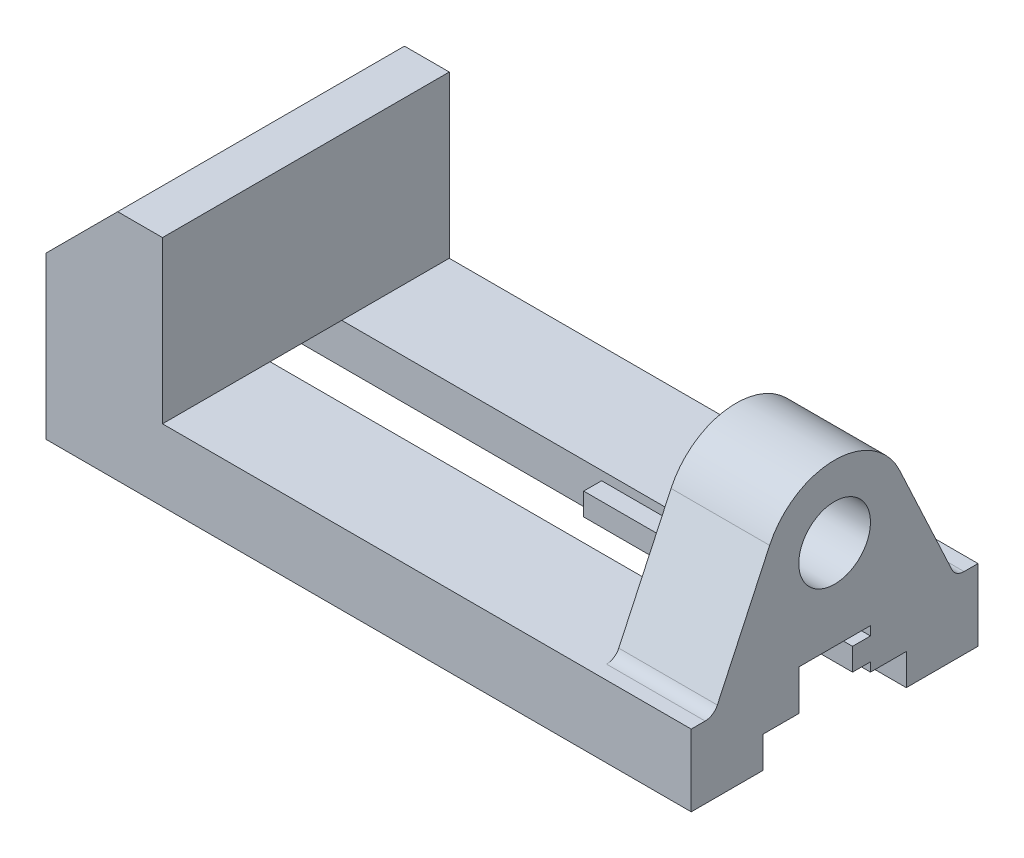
ISO-10303-21;
HEADER;
FILE_DESCRIPTION(('STEP AP214'),'2;1');
FILE_NAME('part.step','',(''),(''),'','','');
FILE_SCHEMA(('AUTOMOTIVE_DESIGN { 1 0 10303 214 1 1 1 1 }'));
ENDSEC;
DATA;
#1=APPLICATION_CONTEXT('core data for automotive mechanical design processes');
#2=APPLICATION_PROTOCOL_DEFINITION('international standard','automotive_design',2000,#1);
#3=PRODUCT_CONTEXT('',#1,'mechanical');
#4=PRODUCT('Part','Part','',(#3));
#5=PRODUCT_RELATED_PRODUCT_CATEGORY('part','',(#4));
#6=PRODUCT_DEFINITION_FORMATION('','',#4);
#7=PRODUCT_DEFINITION_CONTEXT('part definition',#1,'design');
#8=PRODUCT_DEFINITION('design','',#6,#7);
#9=PRODUCT_DEFINITION_SHAPE('','',#8);
#10=(LENGTH_UNIT() NAMED_UNIT(*) SI_UNIT(.MILLI.,.METRE.));
#11=(NAMED_UNIT(*) PLANE_ANGLE_UNIT() SI_UNIT($,.RADIAN.));
#12=(NAMED_UNIT(*) SI_UNIT($,.STERADIAN.) SOLID_ANGLE_UNIT());
#13=UNCERTAINTY_MEASURE_WITH_UNIT(LENGTH_MEASURE(1.E-05),#10,'distance_accuracy_value','');
#14=(GEOMETRIC_REPRESENTATION_CONTEXT(3) GLOBAL_UNCERTAINTY_ASSIGNED_CONTEXT((#13)) GLOBAL_UNIT_ASSIGNED_CONTEXT((#10,
#11,#12)) REPRESENTATION_CONTEXT('',''));
#15=CARTESIAN_POINT('',(0.,0.,0.));
#16=DIRECTION('',(0.,0.,1.));
#17=DIRECTION('',(1.,0.,0.));
#18=AXIS2_PLACEMENT_3D('',#15,#16,#17);
#19=CARTESIAN_POINT('',(26.,16.,32.));
#20=DIRECTION('',(0.,-1.,0.));
#21=DIRECTION('',(0.,0.,-1.));
#22=AXIS2_PLACEMENT_3D('',#19,#20,#21);
#23=PLANE('',#22);
#24=DIRECTION('',(0.,0.,-1.));
#25=VECTOR('',#24,1.);
#26=CARTESIAN_POINT('',(144.,16.,32.));
#27=LINE('',#26,#25);
#28=CARTESIAN_POINT('',(144.,16.,32.));
#29=VERTEX_POINT('',#28);
#30=CARTESIAN_POINT('',(144.,16.,28.8914106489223));
#31=VERTEX_POINT('',#30);
#32=EDGE_CURVE('E433',#29,#31,#27,.T.);
#33=ORIENTED_EDGE('',*,*,#32,.T.);
#34=DIRECTION('',(1.,0.,0.));
#35=VECTOR('',#34,1.);
#36=CARTESIAN_POINT('',(26.,16.,28.8914106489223));
#37=LINE('',#36,#35);
#38=CARTESIAN_POINT('',(122.,16.,28.8914106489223));
#39=VERTEX_POINT('',#38);
#40=EDGE_CURVE('E444',#31,#39,#37,.F.);
#41=ORIENTED_EDGE('',*,*,#40,.T.);
#42=DIRECTION('',(0.,0.,-1.));
#43=VECTOR('',#42,1.);
#44=CARTESIAN_POINT('',(122.,16.,26.9801998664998));
#45=LINE('',#44,#43);
#46=CARTESIAN_POINT('',(122.,16.,8.));
#47=VERTEX_POINT('',#46);
#48=EDGE_CURVE('E361',#39,#47,#45,.T.);
#49=ORIENTED_EDGE('',*,*,#48,.T.);
#50=DIRECTION('',(1.,0.,0.));
#51=VECTOR('',#50,1.);
#52=CARTESIAN_POINT('',(0.,16.,8.));
#53=LINE('',#52,#51);
#54=CARTESIAN_POINT('',(26.,16.,8.));
#55=VERTEX_POINT('',#54);
#56=EDGE_CURVE('E338',#55,#47,#53,.T.);
#57=ORIENTED_EDGE('',*,*,#56,.F.);
#58=DIRECTION('',(0.,0.,-1.));
#59=VECTOR('',#58,1.);
#60=CARTESIAN_POINT('',(26.,16.,32.));
#61=LINE('',#60,#59);
#62=CARTESIAN_POINT('',(26.,16.,32.));
#63=VERTEX_POINT('',#62);
#64=EDGE_CURVE('E429',#63,#55,#61,.T.);
#65=ORIENTED_EDGE('',*,*,#64,.F.);
#66=DIRECTION('',(-1.,0.,0.));
#67=VECTOR('',#66,1.);
#68=CARTESIAN_POINT('',(26.,16.,32.));
#69=LINE('',#68,#67);
#70=EDGE_CURVE('E382',#29,#63,#69,.T.);
#71=ORIENTED_EDGE('',*,*,#70,.F.);
#72=EDGE_LOOP('',(#33,#41,#49,#57,#65,#71));
#73=FACE_BOUND('',#72,.T.);
#74=ADVANCED_FACE('F31',(#73),#23,.F.);
#75=CARTESIAN_POINT('',(144.,0.,32.));
#76=DIRECTION('',(0.,1.,0.));
#77=DIRECTION('',(-1.,0.,0.));
#78=AXIS2_PLACEMENT_3D('',#75,#76,#77);
#79=PLANE('',#78);
#80=CARTESIAN_POINT('',(36.,0.,22.));
#81=DIRECTION('',(0.,-1.,0.));
#82=DIRECTION('',(0.,0.,-1.));
#83=AXIS2_PLACEMENT_3D('',#80,#81,#82);
#84=CIRCLE('',#83,3.);
#85=CARTESIAN_POINT('',(36.,0.,19.));
#86=VERTEX_POINT('',#85);
#87=EDGE_CURVE('E261',#86,#86,#84,.T.);
#88=ORIENTED_EDGE('',*,*,#87,.F.);
#89=EDGE_LOOP('',(#88));
#90=FACE_BOUND('',#89,.T.);
#91=CARTESIAN_POINT('',(106.,0.,22.));
#92=DIRECTION('',(0.,-1.,0.));
#93=DIRECTION('',(0.,0.,-1.));
#94=AXIS2_PLACEMENT_3D('',#91,#92,#93);
#95=CIRCLE('',#94,3.);
#96=CARTESIAN_POINT('',(106.,0.,19.));
#97=VERTEX_POINT('',#96);
#98=EDGE_CURVE('E273',#97,#97,#95,.T.);
#99=ORIENTED_EDGE('',*,*,#98,.F.);
#100=EDGE_LOOP('',(#99));
#101=FACE_BOUND('',#100,.T.);
#102=DIRECTION('',(0.,0.,-1.));
#103=VECTOR('',#102,1.);
#104=CARTESIAN_POINT('',(0.,0.,32.));
#105=LINE('',#104,#103);
#106=CARTESIAN_POINT('',(0.,0.,32.));
#107=VERTEX_POINT('',#106);
#108=CARTESIAN_POINT('',(0.,0.,16.));
#109=VERTEX_POINT('',#108);
#110=EDGE_CURVE('E416',#107,#109,#105,.T.);
#111=ORIENTED_EDGE('',*,*,#110,.T.);
#112=DIRECTION('',(1.,0.,0.));
#113=VECTOR('',#112,1.);
#114=CARTESIAN_POINT('',(0.,0.,16.));
#115=LINE('',#114,#113);
#116=CARTESIAN_POINT('',(144.,0.,16.));
#117=VERTEX_POINT('',#116);
#118=EDGE_CURVE('E327',#109,#117,#115,.T.);
#119=ORIENTED_EDGE('',*,*,#118,.T.);
#120=DIRECTION('',(0.,0.,-1.));
#121=VECTOR('',#120,1.);
#122=CARTESIAN_POINT('',(144.,0.,32.));
#123=LINE('',#122,#121);
#124=CARTESIAN_POINT('',(144.,0.,32.));
#125=VERTEX_POINT('',#124);
#126=EDGE_CURVE('E412',#125,#117,#123,.T.);
#127=ORIENTED_EDGE('',*,*,#126,.F.);
#128=DIRECTION('',(1.,0.,0.));
#129=VECTOR('',#128,1.);
#130=CARTESIAN_POINT('',(144.,0.,32.));
#131=LINE('',#130,#129);
#132=EDGE_CURVE('E393',#107,#125,#131,.T.);
#133=ORIENTED_EDGE('',*,*,#132,.F.);
#134=EDGE_LOOP('',(#111,#119,#127,#133));
#135=FACE_BOUND('',#134,.T.);
#136=ADVANCED_FACE('F538',(#90,#101,#135),#79,.F.);
#137=CARTESIAN_POINT('',(144.,16.,32.));
#138=DIRECTION('',(-1.,0.,0.));
#139=DIRECTION('',(0.,0.,1.));
#140=AXIS2_PLACEMENT_3D('',#137,#138,#139);
#141=PLANE('',#140);
#142=CARTESIAN_POINT('',(144.,36.,0.));
#143=DIRECTION('',(1.,0.,0.));
#144=DIRECTION('',(0.,0.,-1.));
#145=AXIS2_PLACEMENT_3D('',#142,#143,#144);
#146=CIRCLE('',#145,8.);
#147=CARTESIAN_POINT('',(144.,36.,-8.));
#148=VERTEX_POINT('',#147);
#149=EDGE_CURVE('E279',#148,#148,#146,.T.);
#150=ORIENTED_EDGE('',*,*,#149,.F.);
#151=EDGE_LOOP('',(#150));
#152=FACE_BOUND('',#151,.T.);
#153=ORIENTED_EDGE('',*,*,#126,.T.);
#154=DIRECTION('',(0.,-1.,0.));
#155=VECTOR('',#154,1.);
#156=CARTESIAN_POINT('',(144.,0.,16.));
#157=LINE('',#156,#155);
#158=CARTESIAN_POINT('',(144.,7.,16.));
#159=VERTEX_POINT('',#158);
#160=EDGE_CURVE('E290',#159,#117,#157,.T.);
#161=ORIENTED_EDGE('',*,*,#160,.F.);
#162=DIRECTION('',(0.,0.,1.));
#163=VECTOR('',#162,1.);
#164=CARTESIAN_POINT('',(144.,7.,16.));
#165=LINE('',#164,#163);
#166=CARTESIAN_POINT('',(144.,7.,8.));
#167=VERTEX_POINT('',#166);
#168=EDGE_CURVE('E323',#167,#159,#165,.T.);
#169=ORIENTED_EDGE('',*,*,#168,.F.);
#170=DIRECTION('',(0.,-1.,0.));
#171=VECTOR('',#170,1.);
#172=CARTESIAN_POINT('',(144.,7.,8.));
#173=LINE('',#172,#171);
#174=CARTESIAN_POINT('',(144.,16.,8.));
#175=VERTEX_POINT('',#174);
#176=EDGE_CURVE('E320',#175,#167,#173,.T.);
#177=ORIENTED_EDGE('',*,*,#176,.F.);
#178=DIRECTION('',(0.,0.,1.));
#179=VECTOR('',#178,1.);
#180=CARTESIAN_POINT('',(144.,16.,8.));
#181=LINE('',#180,#179);
#182=CARTESIAN_POINT('',(144.,16.,-8.));
#183=VERTEX_POINT('',#182);
#184=EDGE_CURVE('E317',#183,#175,#181,.T.);
#185=ORIENTED_EDGE('',*,*,#184,.F.);
#186=DIRECTION('',(0.,1.,0.));
#187=VECTOR('',#186,1.);
#188=CARTESIAN_POINT('',(144.,16.,-8.));
#189=LINE('',#188,#187);
#190=CARTESIAN_POINT('',(144.,13.9999999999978,-8.));
#191=VERTEX_POINT('',#190);
#192=EDGE_CURVE('E314',#191,#183,#189,.T.);
#193=ORIENTED_EDGE('',*,*,#192,.F.);
#194=DIRECTION('',(0.,0.,1.));
#195=VECTOR('',#194,1.);
#196=CARTESIAN_POINT('',(144.,13.9999999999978,-8.));
#197=LINE('',#196,#195);
#198=CARTESIAN_POINT('',(144.,13.9999999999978,-4.));
#199=VERTEX_POINT('',#198);
#200=EDGE_CURVE('E247',#191,#199,#197,.T.);
#201=ORIENTED_EDGE('',*,*,#200,.T.);
#202=DIRECTION('',(0.,-1.,0.));
#203=VECTOR('',#202,1.);
#204=CARTESIAN_POINT('',(144.,13.9999999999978,-4.));
#205=LINE('',#204,#203);
#206=CARTESIAN_POINT('',(144.,8.9999999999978,-4.));
#207=VERTEX_POINT('',#206);
#208=EDGE_CURVE('E226',#199,#207,#205,.T.);
#209=ORIENTED_EDGE('',*,*,#208,.T.);
#210=DIRECTION('',(0.,0.,-1.));
#211=VECTOR('',#210,1.);
#212=CARTESIAN_POINT('',(144.,8.9999999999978,-8.));
#213=LINE('',#212,#211);
#214=CARTESIAN_POINT('',(144.,8.9999999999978,-8.));
#215=VERTEX_POINT('',#214);
#216=EDGE_CURVE('E243',#207,#215,#213,.T.);
#217=ORIENTED_EDGE('',*,*,#216,.T.);
#218=CARTESIAN_POINT('',(144.,7.,-8.));
#219=VERTEX_POINT('',#218);
#220=EDGE_CURVE('E315',#219,#215,#189,.T.);
#221=ORIENTED_EDGE('',*,*,#220,.F.);
#222=DIRECTION('',(0.,0.,1.));
#223=VECTOR('',#222,1.);
#224=CARTESIAN_POINT('',(144.,7.,-8.));
#225=LINE('',#224,#223);
#226=CARTESIAN_POINT('',(144.,7.,-16.));
#227=VERTEX_POINT('',#226);
#228=EDGE_CURVE('E311',#227,#219,#225,.T.);
#229=ORIENTED_EDGE('',*,*,#228,.F.);
#230=DIRECTION('',(0.,1.,0.));
#231=VECTOR('',#230,1.);
#232=CARTESIAN_POINT('',(144.,7.,-16.));
#233=LINE('',#232,#231);
#234=CARTESIAN_POINT('',(144.,0.,-16.));
#235=VERTEX_POINT('',#234);
#236=EDGE_CURVE('E283',#235,#227,#233,.T.);
#237=ORIENTED_EDGE('',*,*,#236,.F.);
#238=CARTESIAN_POINT('',(144.,0.,-32.));
#239=VERTEX_POINT('',#238);
#240=EDGE_CURVE('E395',#235,#239,#123,.T.);
#241=ORIENTED_EDGE('',*,*,#240,.T.);
#242=DIRECTION('',(0.,1.,0.));
#243=VECTOR('',#242,1.);
#244=CARTESIAN_POINT('',(144.,16.,-32.));
#245=LINE('',#244,#243);
#246=CARTESIAN_POINT('',(144.,16.,-32.));
#247=VERTEX_POINT('',#246);
#248=EDGE_CURVE('E377',#239,#247,#245,.T.);
#249=ORIENTED_EDGE('',*,*,#248,.T.);
#250=CARTESIAN_POINT('',(144.,16.,-28.8914106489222));
#251=VERTEX_POINT('',#250);
#252=EDGE_CURVE('E432',#251,#247,#27,.T.);
#253=ORIENTED_EDGE('',*,*,#252,.F.);
#254=CARTESIAN_POINT('',(144.,19.,-28.8914106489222));
#255=DIRECTION('',(-1.,0.,0.));
#256=DIRECTION('',(0.,0.,1.));
#257=AXIS2_PLACEMENT_3D('',#254,#255,#256);
#258=CIRCLE('',#257,3.);
#259=CARTESIAN_POINT('',(144.,17.7321452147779,-26.1724872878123));
#260=VERTEX_POINT('',#259);
#261=EDGE_CURVE('E447',#251,#260,#258,.T.);
#262=ORIENTED_EDGE('',*,*,#261,.T.);
#263=DIRECTION('',(0.,0.906307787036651,0.422618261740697));
#264=VECTOR('',#263,1.);
#265=CARTESIAN_POINT('',(144.,16.,-26.9801998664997));
#266=LINE('',#265,#264);
#267=CARTESIAN_POINT('',(144.,42.7618921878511,-14.5009245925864));
#268=VERTEX_POINT('',#267);
#269=EDGE_CURVE('E357',#260,#268,#266,.T.);
#270=ORIENTED_EDGE('',*,*,#269,.T.);
#271=CARTESIAN_POINT('',(144.,36.,0.));
#272=DIRECTION('',(1.,0.,0.));
#273=DIRECTION('',(0.,0.,1.));
#274=AXIS2_PLACEMENT_3D('',#271,#272,#273);
#275=CIRCLE('',#274,16.);
#276=CARTESIAN_POINT('',(144.,42.7618921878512,14.5009245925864));
#277=VERTEX_POINT('',#276);
#278=EDGE_CURVE('E352',#268,#277,#275,.T.);
#279=ORIENTED_EDGE('',*,*,#278,.T.);
#280=DIRECTION('',(0.,-0.906307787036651,0.422618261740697));
#281=VECTOR('',#280,1.);
#282=CARTESIAN_POINT('',(144.,42.7618921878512,14.5009245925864));
#283=LINE('',#282,#281);
#284=CARTESIAN_POINT('',(144.,17.7321452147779,26.1724872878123));
#285=VERTEX_POINT('',#284);
#286=EDGE_CURVE('E370',#277,#285,#283,.T.);
#287=ORIENTED_EDGE('',*,*,#286,.T.);
#288=CARTESIAN_POINT('',(144.,19.,28.8914106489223));
#289=DIRECTION('',(-1.,0.,0.));
#290=DIRECTION('',(0.,0.,1.));
#291=AXIS2_PLACEMENT_3D('',#288,#289,#290);
#292=CIRCLE('',#291,3.);
#293=EDGE_CURVE('E39',#285,#31,#292,.T.);
#294=ORIENTED_EDGE('',*,*,#293,.T.);
#295=ORIENTED_EDGE('',*,*,#32,.F.);
#296=DIRECTION('',(0.,1.,0.));
#297=VECTOR('',#296,1.);
#298=CARTESIAN_POINT('',(144.,16.,32.));
#299=LINE('',#298,#297);
#300=EDGE_CURVE('E379',#125,#29,#299,.T.);
#301=ORIENTED_EDGE('',*,*,#300,.F.);
#302=EDGE_LOOP('',(#153,#161,#169,#177,#185,#193,#201,#209,#217,#221,#229,#237,#241,#249,#253,
#262,#270,#279,#287,#294,#295,#301));
#303=FACE_BOUND('',#302,.T.);
#304=ADVANCED_FACE('F453',(#152,#303),#141,.F.);
#305=CARTESIAN_POINT('',(122.,16.,-8.));
#306=VERTEX_POINT('',#305);
#307=CARTESIAN_POINT('',(122.,16.,-28.8914106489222));
#308=VERTEX_POINT('',#307);
#309=EDGE_CURVE('E360',#306,#308,#45,.T.);
#310=ORIENTED_EDGE('',*,*,#309,.T.);
#311=DIRECTION('',(1.,0.,0.));
#312=VECTOR('',#311,1.);
#313=CARTESIAN_POINT('',(26.,16.,-28.8914106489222));
#314=LINE('',#313,#312);
#315=EDGE_CURVE('E436',#308,#251,#314,.T.);
#316=ORIENTED_EDGE('',*,*,#315,.T.);
#317=ORIENTED_EDGE('',*,*,#252,.T.);
#318=DIRECTION('',(-1.,0.,0.));
#319=VECTOR('',#318,1.);
#320=CARTESIAN_POINT('',(26.,16.,-32.));
#321=LINE('',#320,#319);
#322=CARTESIAN_POINT('',(26.,16.,-32.));
#323=VERTEX_POINT('',#322);
#324=EDGE_CURVE('E398',#247,#323,#321,.T.);
#325=ORIENTED_EDGE('',*,*,#324,.T.);
#326=CARTESIAN_POINT('',(26.,16.,-8.));
#327=VERTEX_POINT('',#326);
#328=EDGE_CURVE('E428',#327,#323,#61,.T.);
#329=ORIENTED_EDGE('',*,*,#328,.F.);
#330=DIRECTION('',(1.,0.,0.));
#331=VECTOR('',#330,1.);
#332=CARTESIAN_POINT('',(0.,16.,-8.));
#333=LINE('',#332,#331);
#334=EDGE_CURVE('E343',#327,#306,#333,.T.);
#335=ORIENTED_EDGE('',*,*,#334,.T.);
#336=EDGE_LOOP('',(#310,#316,#317,#325,#329,#335));
#337=FACE_BOUND('',#336,.T.);
#338=ADVANCED_FACE('F483',(#337),#23,.F.);
#339=CARTESIAN_POINT('',(26.,52.,32.));
#340=DIRECTION('',(-1.,0.,0.));
#341=DIRECTION('',(0.,-1.,0.));
#342=AXIS2_PLACEMENT_3D('',#339,#340,#341);
#343=PLANE('',#342);
#344=DIRECTION('',(0.,1.,0.));
#345=VECTOR('',#344,1.);
#346=CARTESIAN_POINT('',(26.,52.,-32.));
#347=LINE('',#346,#345);
#348=CARTESIAN_POINT('',(26.,52.,-32.));
#349=VERTEX_POINT('',#348);
#350=EDGE_CURVE('E401',#323,#349,#347,.T.);
#351=ORIENTED_EDGE('',*,*,#350,.T.);
#352=DIRECTION('',(0.,0.,-1.));
#353=VECTOR('',#352,1.);
#354=CARTESIAN_POINT('',(26.,52.,32.));
#355=LINE('',#354,#353);
#356=CARTESIAN_POINT('',(26.,52.,32.));
#357=VERTEX_POINT('',#356);
#358=EDGE_CURVE('E425',#357,#349,#355,.T.);
#359=ORIENTED_EDGE('',*,*,#358,.F.);
#360=DIRECTION('',(0.,1.,0.));
#361=VECTOR('',#360,1.);
#362=CARTESIAN_POINT('',(26.,52.,32.));
#363=LINE('',#362,#361);
#364=EDGE_CURVE('E385',#63,#357,#363,.T.);
#365=ORIENTED_EDGE('',*,*,#364,.F.);
#366=ORIENTED_EDGE('',*,*,#64,.T.);
#367=DIRECTION('',(0.,0.,-1.));
#368=VECTOR('',#367,1.);
#369=CARTESIAN_POINT('',(26.,16.,32.));
#370=LINE('',#369,#368);
#371=EDGE_CURVE('E330',#55,#327,#370,.T.);
#372=ORIENTED_EDGE('',*,*,#371,.T.);
#373=ORIENTED_EDGE('',*,*,#328,.T.);
#374=EDGE_LOOP('',(#351,#359,#365,#366,#372,#373));
#375=FACE_BOUND('',#374,.T.);
#376=ADVANCED_FACE('F498',(#375),#343,.F.);
#377=CARTESIAN_POINT('',(16.,52.,32.));
#378=DIRECTION('',(0.,-1.,0.));
#379=DIRECTION('',(0.,0.,-1.));
#380=AXIS2_PLACEMENT_3D('',#377,#378,#379);
#381=PLANE('',#380);
#382=DIRECTION('',(-1.,0.,0.));
#383=VECTOR('',#382,1.);
#384=CARTESIAN_POINT('',(16.,52.,-32.));
#385=LINE('',#384,#383);
#386=CARTESIAN_POINT('',(16.,52.,-32.));
#387=VERTEX_POINT('',#386);
#388=EDGE_CURVE('E403',#349,#387,#385,.T.);
#389=ORIENTED_EDGE('',*,*,#388,.T.);
#390=DIRECTION('',(0.,0.,-1.));
#391=VECTOR('',#390,1.);
#392=CARTESIAN_POINT('',(16.,52.,32.));
#393=LINE('',#392,#391);
#394=CARTESIAN_POINT('',(16.,52.,32.));
#395=VERTEX_POINT('',#394);
#396=EDGE_CURVE('E422',#395,#387,#393,.T.);
#397=ORIENTED_EDGE('',*,*,#396,.F.);
#398=DIRECTION('',(-1.,0.,0.));
#399=VECTOR('',#398,1.);
#400=CARTESIAN_POINT('',(16.,52.,32.));
#401=LINE('',#400,#399);
#402=EDGE_CURVE('E387',#357,#395,#401,.T.);
#403=ORIENTED_EDGE('',*,*,#402,.F.);
#404=ORIENTED_EDGE('',*,*,#358,.T.);
#405=EDGE_LOOP('',(#389,#397,#403,#404));
#406=FACE_BOUND('',#405,.T.);
#407=ADVANCED_FACE('F553',(#406),#381,.F.);
#408=CARTESIAN_POINT('',(0.,36.,32.));
#409=DIRECTION('',(0.707106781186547,-0.707106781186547,0.));
#410=DIRECTION('',(0.707106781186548,0.707106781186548,0.));
#411=AXIS2_PLACEMENT_3D('',#408,#409,#410);
#412=PLANE('',#411);
#413=DIRECTION('',(-0.707106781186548,-0.707106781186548,0.));
#414=VECTOR('',#413,1.);
#415=CARTESIAN_POINT('',(0.,36.,-32.));
#416=LINE('',#415,#414);
#417=CARTESIAN_POINT('',(0.,36.,-32.));
#418=VERTEX_POINT('',#417);
#419=EDGE_CURVE('E405',#387,#418,#416,.T.);
#420=ORIENTED_EDGE('',*,*,#419,.T.);
#421=DIRECTION('',(0.,0.,-1.));
#422=VECTOR('',#421,1.);
#423=CARTESIAN_POINT('',(0.,36.,32.));
#424=LINE('',#423,#422);
#425=CARTESIAN_POINT('',(0.,36.,32.));
#426=VERTEX_POINT('',#425);
#427=EDGE_CURVE('E419',#426,#418,#424,.T.);
#428=ORIENTED_EDGE('',*,*,#427,.F.);
#429=DIRECTION('',(-0.707106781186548,-0.707106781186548,0.));
#430=VECTOR('',#429,1.);
#431=CARTESIAN_POINT('',(0.,36.,32.));
#432=LINE('',#431,#430);
#433=EDGE_CURVE('E389',#395,#426,#432,.T.);
#434=ORIENTED_EDGE('',*,*,#433,.F.);
#435=ORIENTED_EDGE('',*,*,#396,.T.);
#436=EDGE_LOOP('',(#420,#428,#434,#435));
#437=FACE_BOUND('',#436,.T.);
#438=ADVANCED_FACE('F643',(#437),#412,.F.);
#439=CARTESIAN_POINT('',(0.,0.,32.));
#440=DIRECTION('',(1.,0.,0.));
#441=DIRECTION('',(0.,0.,-1.));
#442=AXIS2_PLACEMENT_3D('',#439,#440,#441);
#443=PLANE('',#442);
#444=DIRECTION('',(0.,0.,1.));
#445=VECTOR('',#444,1.);
#446=CARTESIAN_POINT('',(0.,7.,16.));
#447=LINE('',#446,#445);
#448=CARTESIAN_POINT('',(0.,7.,8.));
#449=VERTEX_POINT('',#448);
#450=CARTESIAN_POINT('',(0.,7.,16.));
#451=VERTEX_POINT('',#450);
#452=EDGE_CURVE('E302',#449,#451,#447,.T.);
#453=ORIENTED_EDGE('',*,*,#452,.T.);
#454=DIRECTION('',(0.,-1.,0.));
#455=VECTOR('',#454,1.);
#456=CARTESIAN_POINT('',(0.,0.,16.));
#457=LINE('',#456,#455);
#458=EDGE_CURVE('E305',#451,#109,#457,.T.);
#459=ORIENTED_EDGE('',*,*,#458,.T.);
#460=ORIENTED_EDGE('',*,*,#110,.F.);
#461=DIRECTION('',(0.,-1.,0.));
#462=VECTOR('',#461,1.);
#463=CARTESIAN_POINT('',(0.,0.,32.));
#464=LINE('',#463,#462);
#465=EDGE_CURVE('E391',#426,#107,#464,.T.);
#466=ORIENTED_EDGE('',*,*,#465,.F.);
#467=ORIENTED_EDGE('',*,*,#427,.T.);
#468=DIRECTION('',(0.,-1.,0.));
#469=VECTOR('',#468,1.);
#470=CARTESIAN_POINT('',(0.,0.,-32.));
#471=LINE('',#470,#469);
#472=CARTESIAN_POINT('',(0.,0.,-32.));
#473=VERTEX_POINT('',#472);
#474=EDGE_CURVE('E407',#418,#473,#471,.T.);
#475=ORIENTED_EDGE('',*,*,#474,.T.);
#476=CARTESIAN_POINT('',(0.,0.,-16.));
#477=VERTEX_POINT('',#476);
#478=EDGE_CURVE('E415',#477,#473,#105,.T.);
#479=ORIENTED_EDGE('',*,*,#478,.F.);
#480=DIRECTION('',(0.,1.,0.));
#481=VECTOR('',#480,1.);
#482=CARTESIAN_POINT('',(0.,7.,-16.));
#483=LINE('',#482,#481);
#484=CARTESIAN_POINT('',(0.,7.,-16.));
#485=VERTEX_POINT('',#484);
#486=EDGE_CURVE('E286',#477,#485,#483,.T.);
#487=ORIENTED_EDGE('',*,*,#486,.T.);
#488=DIRECTION('',(0.,0.,1.));
#489=VECTOR('',#488,1.);
#490=CARTESIAN_POINT('',(0.,7.,-8.));
#491=LINE('',#490,#489);
#492=CARTESIAN_POINT('',(0.,7.,-8.));
#493=VERTEX_POINT('',#492);
#494=EDGE_CURVE('E289',#485,#493,#491,.T.);
#495=ORIENTED_EDGE('',*,*,#494,.T.);
#496=DIRECTION('',(0.,1.,0.));
#497=VECTOR('',#496,1.);
#498=CARTESIAN_POINT('',(0.,16.,-8.));
#499=LINE('',#498,#497);
#500=CARTESIAN_POINT('',(0.,16.,-8.));
#501=VERTEX_POINT('',#500);
#502=EDGE_CURVE('E293',#493,#501,#499,.T.);
#503=ORIENTED_EDGE('',*,*,#502,.T.);
#504=DIRECTION('',(0.,0.,1.));
#505=VECTOR('',#504,1.);
#506=CARTESIAN_POINT('',(0.,16.,8.));
#507=LINE('',#506,#505);
#508=CARTESIAN_POINT('',(0.,16.,8.));
#509=VERTEX_POINT('',#508);
#510=EDGE_CURVE('E296',#501,#509,#507,.T.);
#511=ORIENTED_EDGE('',*,*,#510,.T.);
#512=DIRECTION('',(0.,-1.,0.));
#513=VECTOR('',#512,1.);
#514=CARTESIAN_POINT('',(0.,7.,8.));
#515=LINE('',#514,#513);
#516=EDGE_CURVE('E299',#509,#449,#515,.T.);
#517=ORIENTED_EDGE('',*,*,#516,.T.);
#518=EDGE_LOOP('',(#453,#459,#460,#466,#467,#475,#479,#487,#495,#503,#511,#517));
#519=FACE_BOUND('',#518,.T.);
#520=ADVANCED_FACE('F521',(#519),#443,.F.);
#521=CARTESIAN_POINT('',(36.,0.,-22.));
#522=DIRECTION('',(0.,-1.,0.));
#523=DIRECTION('',(0.,0.,-1.));
#524=AXIS2_PLACEMENT_3D('',#521,#522,#523);
#525=CIRCLE('',#524,3.);
#526=CARTESIAN_POINT('',(36.,0.,-25.));
#527=VERTEX_POINT('',#526);
#528=EDGE_CURVE('E253',#527,#527,#525,.T.);
#529=ORIENTED_EDGE('',*,*,#528,.F.);
#530=EDGE_LOOP('',(#529));
#531=FACE_BOUND('',#530,.T.);
#532=CARTESIAN_POINT('',(106.,0.,-22.));
#533=DIRECTION('',(0.,-1.,0.));
#534=DIRECTION('',(0.,0.,-1.));
#535=AXIS2_PLACEMENT_3D('',#532,#533,#534);
#536=CIRCLE('',#535,3.);
#537=CARTESIAN_POINT('',(106.,0.,-25.));
#538=VERTEX_POINT('',#537);
#539=EDGE_CURVE('E267',#538,#538,#536,.T.);
#540=ORIENTED_EDGE('',*,*,#539,.F.);
#541=EDGE_LOOP('',(#540));
#542=FACE_BOUND('',#541,.T.);
#543=ORIENTED_EDGE('',*,*,#240,.F.);
#544=DIRECTION('',(1.,0.,0.));
#545=VECTOR('',#544,1.);
#546=CARTESIAN_POINT('',(0.,0.,-16.));
#547=LINE('',#546,#545);
#548=EDGE_CURVE('E308',#477,#235,#547,.T.);
#549=ORIENTED_EDGE('',*,*,#548,.F.);
#550=ORIENTED_EDGE('',*,*,#478,.T.);
#551=DIRECTION('',(1.,0.,0.));
#552=VECTOR('',#551,1.);
#553=CARTESIAN_POINT('',(144.,0.,-32.));
#554=LINE('',#553,#552);
#555=EDGE_CURVE('E383',#473,#239,#554,.T.);
#556=ORIENTED_EDGE('',*,*,#555,.T.);
#557=EDGE_LOOP('',(#543,#549,#550,#556));
#558=FACE_BOUND('',#557,.T.);
#559=ADVANCED_FACE('F545',(#531,#542,#558),#79,.F.);
#560=CARTESIAN_POINT('',(144.,0.,32.));
#561=DIRECTION('',(0.,0.,-1.));
#562=DIRECTION('',(-1.,0.,0.));
#563=AXIS2_PLACEMENT_3D('',#560,#561,#562);
#564=PLANE('',#563);
#565=ORIENTED_EDGE('',*,*,#300,.T.);
#566=ORIENTED_EDGE('',*,*,#70,.T.);
#567=ORIENTED_EDGE('',*,*,#364,.T.);
#568=ORIENTED_EDGE('',*,*,#402,.T.);
#569=ORIENTED_EDGE('',*,*,#433,.T.);
#570=ORIENTED_EDGE('',*,*,#465,.T.);
#571=ORIENTED_EDGE('',*,*,#132,.T.);
#572=EDGE_LOOP('',(#565,#566,#567,#568,#569,#570,#571));
#573=FACE_BOUND('',#572,.T.);
#574=ADVANCED_FACE('F633',(#573),#564,.F.);
#575=CARTESIAN_POINT('',(144.,0.,-32.));
#576=DIRECTION('',(0.,0.,-1.));
#577=DIRECTION('',(-1.,0.,0.));
#578=AXIS2_PLACEMENT_3D('',#575,#576,#577);
#579=PLANE('',#578);
#580=ORIENTED_EDGE('',*,*,#248,.F.);
#581=ORIENTED_EDGE('',*,*,#555,.F.);
#582=ORIENTED_EDGE('',*,*,#474,.F.);
#583=ORIENTED_EDGE('',*,*,#419,.F.);
#584=ORIENTED_EDGE('',*,*,#388,.F.);
#585=ORIENTED_EDGE('',*,*,#350,.F.);
#586=ORIENTED_EDGE('',*,*,#324,.F.);
#587=EDGE_LOOP('',(#580,#581,#582,#583,#584,#585,#586));
#588=FACE_BOUND('',#587,.T.);
#589=ADVANCED_FACE('F492',(#588),#579,.T.);
#590=CARTESIAN_POINT('',(122.,36.,0.));
#591=DIRECTION('',(1.,0.,0.));
#592=DIRECTION('',(0.,0.,-1.));
#593=AXIS2_PLACEMENT_3D('',#590,#591,#592);
#594=CYLINDRICAL_SURFACE('',#593,16.);
#595=ORIENTED_EDGE('',*,*,#278,.F.);
#596=DIRECTION('',(1.,0.,0.));
#597=VECTOR('',#596,1.);
#598=CARTESIAN_POINT('',(122.,42.7618921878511,-14.5009245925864));
#599=LINE('',#598,#597);
#600=CARTESIAN_POINT('',(122.,42.7618921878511,-14.5009245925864));
#601=VERTEX_POINT('',#600);
#602=EDGE_CURVE('E374',#601,#268,#599,.T.);
#603=ORIENTED_EDGE('',*,*,#602,.F.);
#604=CARTESIAN_POINT('',(122.,36.,0.));
#605=DIRECTION('',(1.,0.,0.));
#606=DIRECTION('',(0.,0.,1.));
#607=AXIS2_PLACEMENT_3D('',#604,#605,#606);
#608=CIRCLE('',#607,16.);
#609=CARTESIAN_POINT('',(122.,42.7618921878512,14.5009245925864));
#610=VERTEX_POINT('',#609);
#611=EDGE_CURVE('E353',#601,#610,#608,.T.);
#612=ORIENTED_EDGE('',*,*,#611,.T.);
#613=DIRECTION('',(1.,0.,0.));
#614=VECTOR('',#613,1.);
#615=CARTESIAN_POINT('',(122.,42.7618921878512,14.5009245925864));
#616=LINE('',#615,#614);
#617=EDGE_CURVE('E367',#610,#277,#616,.T.);
#618=ORIENTED_EDGE('',*,*,#617,.T.);
#619=EDGE_LOOP('',(#595,#603,#612,#618));
#620=FACE_BOUND('',#619,.T.);
#621=ADVANCED_FACE('F471',(#620),#594,.T.);
#622=CARTESIAN_POINT('',(122.,16.,-26.9801998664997));
#623=DIRECTION('',(0.,0.422618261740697,-0.906307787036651));
#624=DIRECTION('',(0.,0.906307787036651,0.422618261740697));
#625=AXIS2_PLACEMENT_3D('',#622,#623,#624);
#626=PLANE('',#625);
#627=ORIENTED_EDGE('',*,*,#269,.F.);
#628=DIRECTION('',(1.,0.,0.));
#629=VECTOR('',#628,1.);
#630=CARTESIAN_POINT('',(122.,17.7321452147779,-26.1724872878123));
#631=LINE('',#630,#629);
#632=CARTESIAN_POINT('',(122.,17.7321452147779,-26.1724872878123));
#633=VERTEX_POINT('',#632);
#634=EDGE_CURVE('E439',#260,#633,#631,.F.);
#635=ORIENTED_EDGE('',*,*,#634,.T.);
#636=DIRECTION('',(0.,0.906307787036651,0.422618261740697));
#637=VECTOR('',#636,1.);
#638=CARTESIAN_POINT('',(122.,16.,-26.9801998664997));
#639=LINE('',#638,#637);
#640=EDGE_CURVE('E364',#633,#601,#639,.T.);
#641=ORIENTED_EDGE('',*,*,#640,.T.);
#642=ORIENTED_EDGE('',*,*,#602,.T.);
#643=EDGE_LOOP('',(#627,#635,#641,#642));
#644=FACE_BOUND('',#643,.T.);
#645=ADVANCED_FACE('F626',(#644),#626,.T.);
#646=CARTESIAN_POINT('',(122.,42.7618921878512,14.5009245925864));
#647=DIRECTION('',(0.,0.422618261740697,0.906307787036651));
#648=DIRECTION('',(0.,-0.906307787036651,0.422618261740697));
#649=AXIS2_PLACEMENT_3D('',#646,#647,#648);
#650=PLANE('',#649);
#651=DIRECTION('',(0.,-0.906307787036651,0.422618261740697));
#652=VECTOR('',#651,1.);
#653=CARTESIAN_POINT('',(122.,42.7618921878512,14.5009245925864));
#654=LINE('',#653,#652);
#655=CARTESIAN_POINT('',(122.,17.7321452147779,26.1724872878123));
#656=VERTEX_POINT('',#655);
#657=EDGE_CURVE('E356',#610,#656,#654,.T.);
#658=ORIENTED_EDGE('',*,*,#657,.T.);
#659=DIRECTION('',(1.,0.,0.));
#660=VECTOR('',#659,1.);
#661=CARTESIAN_POINT('',(122.,17.7321452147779,26.1724872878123));
#662=LINE('',#661,#660);
#663=EDGE_CURVE('E441',#656,#285,#662,.T.);
#664=ORIENTED_EDGE('',*,*,#663,.T.);
#665=ORIENTED_EDGE('',*,*,#286,.F.);
#666=ORIENTED_EDGE('',*,*,#617,.F.);
#667=EDGE_LOOP('',(#658,#664,#665,#666));
#668=FACE_BOUND('',#667,.T.);
#669=ADVANCED_FACE('F468',(#668),#650,.T.);
#670=CARTESIAN_POINT('',(122.,36.,0.));
#671=DIRECTION('',(-1.,0.,0.));
#672=DIRECTION('',(0.,0.,1.));
#673=AXIS2_PLACEMENT_3D('',#670,#671,#672);
#674=PLANE('',#673);
#675=CARTESIAN_POINT('',(122.,36.,0.));
#676=DIRECTION('',(-1.,0.,0.));
#677=DIRECTION('',(0.,0.,1.));
#678=AXIS2_PLACEMENT_3D('',#675,#676,#677);
#679=CIRCLE('',#678,8.);
#680=CARTESIAN_POINT('',(122.,36.,8.));
#681=VERTEX_POINT('',#680);
#682=EDGE_CURVE('E280',#681,#681,#679,.F.);
#683=ORIENTED_EDGE('',*,*,#682,.T.);
#684=EDGE_LOOP('',(#683));
#685=FACE_BOUND('',#684,.T.);
#686=ORIENTED_EDGE('',*,*,#611,.F.);
#687=ORIENTED_EDGE('',*,*,#640,.F.);
#688=CARTESIAN_POINT('',(122.,19.,-28.8914106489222));
#689=DIRECTION('',(-1.,0.,0.));
#690=DIRECTION('',(0.,0.,1.));
#691=AXIS2_PLACEMENT_3D('',#688,#689,#690);
#692=CIRCLE('',#691,3.);
#693=EDGE_CURVE('E449',#633,#308,#692,.F.);
#694=ORIENTED_EDGE('',*,*,#693,.T.);
#695=ORIENTED_EDGE('',*,*,#309,.F.);
#696=EDGE_CURVE('E365',#47,#306,#45,.T.);
#697=ORIENTED_EDGE('',*,*,#696,.F.);
#698=ORIENTED_EDGE('',*,*,#48,.F.);
#699=CARTESIAN_POINT('',(122.,19.,28.8914106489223));
#700=DIRECTION('',(-1.,0.,0.));
#701=DIRECTION('',(0.,0.,1.));
#702=AXIS2_PLACEMENT_3D('',#699,#700,#701);
#703=CIRCLE('',#702,3.);
#704=EDGE_CURVE('E11',#39,#656,#703,.F.);
#705=ORIENTED_EDGE('',*,*,#704,.T.);
#706=ORIENTED_EDGE('',*,*,#657,.F.);
#707=EDGE_LOOP('',(#686,#687,#694,#695,#697,#698,#705,#706));
#708=FACE_BOUND('',#707,.T.);
#709=ADVANCED_FACE('F465',(#685,#708),#674,.T.);
#710=CARTESIAN_POINT('',(0.,16.,8.));
#711=DIRECTION('',(0.,1.,0.));
#712=DIRECTION('',(0.,0.,1.));
#713=AXIS2_PLACEMENT_3D('',#710,#711,#712);
#714=PLANE('',#713);
#715=EDGE_CURVE('E335',#509,#55,#53,.T.);
#716=ORIENTED_EDGE('',*,*,#715,.F.);
#717=ORIENTED_EDGE('',*,*,#510,.F.);
#718=EDGE_CURVE('E340',#501,#327,#333,.T.);
#719=ORIENTED_EDGE('',*,*,#718,.T.);
#720=ORIENTED_EDGE('',*,*,#371,.F.);
#721=EDGE_LOOP('',(#716,#717,#719,#720));
#722=FACE_BOUND('',#721,.T.);
#723=ADVANCED_FACE('F501',(#722),#714,.F.);
#724=CARTESIAN_POINT('',(0.,0.,16.));
#725=DIRECTION('',(0.,0.,1.));
#726=DIRECTION('',(1.,0.,0.));
#727=AXIS2_PLACEMENT_3D('',#724,#725,#726);
#728=PLANE('',#727);
#729=ORIENTED_EDGE('',*,*,#160,.T.);
#730=ORIENTED_EDGE('',*,*,#118,.F.);
#731=ORIENTED_EDGE('',*,*,#458,.F.);
#732=DIRECTION('',(1.,0.,0.));
#733=VECTOR('',#732,1.);
#734=CARTESIAN_POINT('',(0.,7.,16.));
#735=LINE('',#734,#733);
#736=EDGE_CURVE('E331',#451,#159,#735,.T.);
#737=ORIENTED_EDGE('',*,*,#736,.T.);
#738=EDGE_LOOP('',(#729,#730,#731,#737));
#739=FACE_BOUND('',#738,.T.);
#740=ADVANCED_FACE('F604',(#739),#728,.F.);
#741=CARTESIAN_POINT('',(0.,7.,16.));
#742=DIRECTION('',(0.,1.,0.));
#743=DIRECTION('',(0.,0.,1.));
#744=AXIS2_PLACEMENT_3D('',#741,#742,#743);
#745=PLANE('',#744);
#746=ORIENTED_EDGE('',*,*,#168,.T.);
#747=ORIENTED_EDGE('',*,*,#736,.F.);
#748=ORIENTED_EDGE('',*,*,#452,.F.);
#749=DIRECTION('',(1.,0.,0.));
#750=VECTOR('',#749,1.);
#751=CARTESIAN_POINT('',(0.,7.,8.));
#752=LINE('',#751,#750);
#753=EDGE_CURVE('E333',#449,#167,#752,.T.);
#754=ORIENTED_EDGE('',*,*,#753,.T.);
#755=EDGE_LOOP('',(#746,#747,#748,#754));
#756=FACE_BOUND('',#755,.T.);
#757=ADVANCED_FACE('F517',(#756),#745,.F.);
#758=CARTESIAN_POINT('',(0.,7.,8.));
#759=DIRECTION('',(0.,0.,1.));
#760=DIRECTION('',(1.,0.,0.));
#761=AXIS2_PLACEMENT_3D('',#758,#759,#760);
#762=PLANE('',#761);
#763=ORIENTED_EDGE('',*,*,#176,.T.);
#764=ORIENTED_EDGE('',*,*,#753,.F.);
#765=ORIENTED_EDGE('',*,*,#516,.F.);
#766=ORIENTED_EDGE('',*,*,#715,.T.);
#767=ORIENTED_EDGE('',*,*,#56,.T.);
#768=EDGE_CURVE('E339',#47,#175,#53,.T.);
#769=ORIENTED_EDGE('',*,*,#768,.T.);
#770=EDGE_LOOP('',(#763,#764,#765,#766,#767,#769));
#771=FACE_BOUND('',#770,.T.);
#772=ADVANCED_FACE('F506',(#771),#762,.F.);
#773=ORIENTED_EDGE('',*,*,#696,.T.);
#774=EDGE_CURVE('E344',#306,#183,#333,.T.);
#775=ORIENTED_EDGE('',*,*,#774,.T.);
#776=ORIENTED_EDGE('',*,*,#184,.T.);
#777=ORIENTED_EDGE('',*,*,#768,.F.);
#778=EDGE_LOOP('',(#773,#775,#776,#777));
#779=FACE_BOUND('',#778,.T.);
#780=ADVANCED_FACE('F513',(#779),#714,.F.);
#781=CARTESIAN_POINT('',(0.,16.,-8.));
#782=DIRECTION('',(0.,0.,-1.));
#783=DIRECTION('',(-1.,0.,0.));
#784=AXIS2_PLACEMENT_3D('',#781,#782,#783);
#785=PLANE('',#784);
#786=ORIENTED_EDGE('',*,*,#220,.T.);
#787=DIRECTION('',(1.,0.,0.));
#788=VECTOR('',#787,1.);
#789=CARTESIAN_POINT('',(84.,8.9999999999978,-8.));
#790=LINE('',#789,#788);
#791=CARTESIAN_POINT('',(84.,8.9999999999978,-8.));
#792=VERTEX_POINT('',#791);
#793=EDGE_CURVE('E51',#792,#215,#790,.T.);
#794=ORIENTED_EDGE('',*,*,#793,.F.);
#795=DIRECTION('',(0.,1.,0.));
#796=VECTOR('',#795,1.);
#797=CARTESIAN_POINT('',(84.,13.9999999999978,-8.));
#798=LINE('',#797,#796);
#799=CARTESIAN_POINT('',(84.,13.9999999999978,-8.));
#800=VERTEX_POINT('',#799);
#801=EDGE_CURVE('E46',#792,#800,#798,.T.);
#802=ORIENTED_EDGE('',*,*,#801,.T.);
#803=DIRECTION('',(1.,0.,0.));
#804=VECTOR('',#803,1.);
#805=CARTESIAN_POINT('',(84.,13.9999999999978,-8.));
#806=LINE('',#805,#804);
#807=EDGE_CURVE('E232',#800,#191,#806,.T.);
#808=ORIENTED_EDGE('',*,*,#807,.T.);
#809=ORIENTED_EDGE('',*,*,#192,.T.);
#810=ORIENTED_EDGE('',*,*,#774,.F.);
#811=ORIENTED_EDGE('',*,*,#334,.F.);
#812=ORIENTED_EDGE('',*,*,#718,.F.);
#813=ORIENTED_EDGE('',*,*,#502,.F.);
#814=DIRECTION('',(1.,0.,0.));
#815=VECTOR('',#814,1.);
#816=CARTESIAN_POINT('',(0.,7.,-8.));
#817=LINE('',#816,#815);
#818=EDGE_CURVE('E345',#493,#219,#817,.T.);
#819=ORIENTED_EDGE('',*,*,#818,.T.);
#820=EDGE_LOOP('',(#786,#794,#802,#808,#809,#810,#811,#812,#813,#819));
#821=FACE_BOUND('',#820,.T.);
#822=ADVANCED_FACE('F524',(#821),#785,.F.);
#823=CARTESIAN_POINT('',(0.,7.,-8.));
#824=DIRECTION('',(0.,1.,0.));
#825=DIRECTION('',(0.,0.,1.));
#826=AXIS2_PLACEMENT_3D('',#823,#824,#825);
#827=PLANE('',#826);
#828=ORIENTED_EDGE('',*,*,#228,.T.);
#829=ORIENTED_EDGE('',*,*,#818,.F.);
#830=ORIENTED_EDGE('',*,*,#494,.F.);
#831=DIRECTION('',(1.,0.,0.));
#832=VECTOR('',#831,1.);
#833=CARTESIAN_POINT('',(0.,7.,-16.));
#834=LINE('',#833,#832);
#835=EDGE_CURVE('E347',#485,#227,#834,.T.);
#836=ORIENTED_EDGE('',*,*,#835,.T.);
#837=EDGE_LOOP('',(#828,#829,#830,#836));
#838=FACE_BOUND('',#837,.T.);
#839=ADVANCED_FACE('F616',(#838),#827,.F.);
#840=CARTESIAN_POINT('',(0.,7.,-16.));
#841=DIRECTION('',(0.,0.,-1.));
#842=DIRECTION('',(-1.,0.,0.));
#843=AXIS2_PLACEMENT_3D('',#840,#841,#842);
#844=PLANE('',#843);
#845=ORIENTED_EDGE('',*,*,#236,.T.);
#846=ORIENTED_EDGE('',*,*,#835,.F.);
#847=ORIENTED_EDGE('',*,*,#486,.F.);
#848=ORIENTED_EDGE('',*,*,#548,.T.);
#849=EDGE_LOOP('',(#845,#846,#847,#848));
#850=FACE_BOUND('',#849,.T.);
#851=ADVANCED_FACE('F602',(#850),#844,.F.);
#852=CARTESIAN_POINT('',(-0.001000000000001,36.,0.));
#853=DIRECTION('',(1.,0.,0.));
#854=DIRECTION('',(0.,0.,-1.));
#855=AXIS2_PLACEMENT_3D('',#852,#853,#854);
#856=CYLINDRICAL_SURFACE('',#855,8.);
#857=ORIENTED_EDGE('',*,*,#682,.F.);
#858=EDGE_LOOP('',(#857));
#859=FACE_BOUND('',#858,.T.);
#860=ORIENTED_EDGE('',*,*,#149,.T.);
#861=EDGE_LOOP('',(#860));
#862=FACE_BOUND('',#861,.T.);
#863=ADVANCED_FACE('F598',(#859,#862),#856,.F.);
#864=CARTESIAN_POINT('',(106.,10.,22.));
#865=DIRECTION('',(0.,-1.,0.));
#866=DIRECTION('',(0.,0.,-1.));
#867=AXIS2_PLACEMENT_3D('',#864,#865,#866);
#868=CONICAL_SURFACE('',#867,3.,1.0471975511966);
#869=CARTESIAN_POINT('',(106.,11.7320508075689,22.));
#870=VERTEX_POINT('',#869);
#871=VERTEX_LOOP('',#870);
#872=FACE_BOUND('',#871,.T.);
#873=CARTESIAN_POINT('',(106.,10.,22.));
#874=DIRECTION('',(0.,-1.,0.));
#875=DIRECTION('',(0.,0.,-1.));
#876=AXIS2_PLACEMENT_3D('',#873,#874,#875);
#877=CIRCLE('',#876,3.);
#878=CARTESIAN_POINT('',(106.,10.,19.));
#879=VERTEX_POINT('',#878);
#880=EDGE_CURVE('E276',#879,#879,#877,.T.);
#881=ORIENTED_EDGE('',*,*,#880,.T.);
#882=EDGE_LOOP('',(#881));
#883=FACE_BOUND('',#882,.T.);
#884=ADVANCED_FACE('F594',(#872,#883),#868,.F.);
#885=CARTESIAN_POINT('',(106.,0.,22.));
#886=DIRECTION('',(0.,-1.,0.));
#887=DIRECTION('',(0.,0.,-1.));
#888=AXIS2_PLACEMENT_3D('',#885,#886,#887);
#889=CYLINDRICAL_SURFACE('',#888,3.);
#890=ORIENTED_EDGE('',*,*,#880,.F.);
#891=EDGE_LOOP('',(#890));
#892=FACE_BOUND('',#891,.T.);
#893=ORIENTED_EDGE('',*,*,#98,.T.);
#894=EDGE_LOOP('',(#893));
#895=FACE_BOUND('',#894,.T.);
#896=ADVANCED_FACE('F590',(#892,#895),#889,.F.);
#897=CARTESIAN_POINT('',(106.,9.99999999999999,-22.));
#898=DIRECTION('',(0.,-1.,0.));
#899=DIRECTION('',(0.,0.,-1.));
#900=AXIS2_PLACEMENT_3D('',#897,#898,#899);
#901=CONICAL_SURFACE('',#900,3.,1.0471975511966);
#902=CARTESIAN_POINT('',(106.,11.7320508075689,-22.));
#903=VERTEX_POINT('',#902);
#904=VERTEX_LOOP('',#903);
#905=FACE_BOUND('',#904,.T.);
#906=CARTESIAN_POINT('',(106.,9.99999999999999,-22.));
#907=DIRECTION('',(0.,-1.,0.));
#908=DIRECTION('',(0.,0.,-1.));
#909=AXIS2_PLACEMENT_3D('',#906,#907,#908);
#910=CIRCLE('',#909,3.);
#911=CARTESIAN_POINT('',(106.,9.99999999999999,-25.));
#912=VERTEX_POINT('',#911);
#913=EDGE_CURVE('E270',#912,#912,#910,.T.);
#914=ORIENTED_EDGE('',*,*,#913,.T.);
#915=EDGE_LOOP('',(#914));
#916=FACE_BOUND('',#915,.T.);
#917=ADVANCED_FACE('F586',(#905,#916),#901,.F.);
#918=CARTESIAN_POINT('',(106.,0.,-22.));
#919=DIRECTION('',(0.,-1.,0.));
#920=DIRECTION('',(0.,0.,-1.));
#921=AXIS2_PLACEMENT_3D('',#918,#919,#920);
#922=CYLINDRICAL_SURFACE('',#921,3.);
#923=ORIENTED_EDGE('',*,*,#913,.F.);
#924=EDGE_LOOP('',(#923));
#925=FACE_BOUND('',#924,.T.);
#926=ORIENTED_EDGE('',*,*,#539,.T.);
#927=EDGE_LOOP('',(#926));
#928=FACE_BOUND('',#927,.T.);
#929=ADVANCED_FACE('F582',(#925,#928),#922,.F.);
#930=CARTESIAN_POINT('',(36.,10.,22.));
#931=DIRECTION('',(0.,-1.,0.));
#932=DIRECTION('',(0.,0.,-1.));
#933=AXIS2_PLACEMENT_3D('',#930,#931,#932);
#934=CONICAL_SURFACE('',#933,3.,1.0471975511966);
#935=CARTESIAN_POINT('',(36.,11.7320508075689,22.));
#936=VERTEX_POINT('',#935);
#937=VERTEX_LOOP('',#936);
#938=FACE_BOUND('',#937,.T.);
#939=CARTESIAN_POINT('',(36.,10.,22.));
#940=DIRECTION('',(0.,-1.,0.));
#941=DIRECTION('',(0.,0.,-1.));
#942=AXIS2_PLACEMENT_3D('',#939,#940,#941);
#943=CIRCLE('',#942,3.);
#944=CARTESIAN_POINT('',(36.,10.,19.));
#945=VERTEX_POINT('',#944);
#946=EDGE_CURVE('E264',#945,#945,#943,.T.);
#947=ORIENTED_EDGE('',*,*,#946,.T.);
#948=EDGE_LOOP('',(#947));
#949=FACE_BOUND('',#948,.T.);
#950=ADVANCED_FACE('F578',(#938,#949),#934,.F.);
#951=CARTESIAN_POINT('',(36.,0.,22.));
#952=DIRECTION('',(0.,-1.,0.));
#953=DIRECTION('',(0.,0.,-1.));
#954=AXIS2_PLACEMENT_3D('',#951,#952,#953);
#955=CYLINDRICAL_SURFACE('',#954,3.);
#956=ORIENTED_EDGE('',*,*,#946,.F.);
#957=EDGE_LOOP('',(#956));
#958=FACE_BOUND('',#957,.T.);
#959=ORIENTED_EDGE('',*,*,#87,.T.);
#960=EDGE_LOOP('',(#959));
#961=FACE_BOUND('',#960,.T.);
#962=ADVANCED_FACE('F569',(#958,#961),#955,.F.);
#963=CARTESIAN_POINT('',(36.,9.99999999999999,-22.));
#964=DIRECTION('',(0.,-1.,0.));
#965=DIRECTION('',(0.,0.,-1.));
#966=AXIS2_PLACEMENT_3D('',#963,#964,#965);
#967=CONICAL_SURFACE('',#966,3.,1.0471975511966);
#968=CARTESIAN_POINT('',(36.,11.7320508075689,-22.));
#969=VERTEX_POINT('',#968);
#970=VERTEX_LOOP('',#969);
#971=FACE_BOUND('',#970,.T.);
#972=CARTESIAN_POINT('',(36.,9.99999999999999,-22.));
#973=DIRECTION('',(0.,-1.,0.));
#974=DIRECTION('',(0.,0.,-1.));
#975=AXIS2_PLACEMENT_3D('',#972,#973,#974);
#976=CIRCLE('',#975,3.);
#977=CARTESIAN_POINT('',(36.,9.99999999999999,-25.));
#978=VERTEX_POINT('',#977);
#979=EDGE_CURVE('E258',#978,#978,#976,.T.);
#980=ORIENTED_EDGE('',*,*,#979,.T.);
#981=EDGE_LOOP('',(#980));
#982=FACE_BOUND('',#981,.T.);
#983=ADVANCED_FACE('F563',(#971,#982),#967,.F.);
#984=CARTESIAN_POINT('',(36.,0.,-22.));
#985=DIRECTION('',(0.,-1.,0.));
#986=DIRECTION('',(0.,0.,-1.));
#987=AXIS2_PLACEMENT_3D('',#984,#985,#986);
#988=CYLINDRICAL_SURFACE('',#987,3.);
#989=ORIENTED_EDGE('',*,*,#979,.F.);
#990=EDGE_LOOP('',(#989));
#991=FACE_BOUND('',#990,.T.);
#992=ORIENTED_EDGE('',*,*,#528,.T.);
#993=EDGE_LOOP('',(#992));
#994=FACE_BOUND('',#993,.T.);
#995=ADVANCED_FACE('F559',(#991,#994),#988,.F.);
#996=CARTESIAN_POINT('',(26.,19.,-28.8914106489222));
#997=DIRECTION('',(1.,0.,0.));
#998=DIRECTION('',(0.,0.,-1.));
#999=AXIS2_PLACEMENT_3D('',#996,#997,#998);
#1000=CYLINDRICAL_SURFACE('',#999,3.);
#1001=ORIENTED_EDGE('',*,*,#693,.F.);
#1002=ORIENTED_EDGE('',*,*,#634,.F.);
#1003=ORIENTED_EDGE('',*,*,#261,.F.);
#1004=ORIENTED_EDGE('',*,*,#315,.F.);
#1005=EDGE_LOOP('',(#1001,#1002,#1003,#1004));
#1006=FACE_BOUND('',#1005,.T.);
#1007=ADVANCED_FACE('F480',(#1006),#1000,.F.);
#1008=CARTESIAN_POINT('',(122.,19.,28.8914106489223));
#1009=DIRECTION('',(1.,0.,0.));
#1010=DIRECTION('',(0.,0.,-1.));
#1011=AXIS2_PLACEMENT_3D('',#1008,#1009,#1010);
#1012=CYLINDRICAL_SURFACE('',#1011,3.);
#1013=ORIENTED_EDGE('',*,*,#704,.F.);
#1014=ORIENTED_EDGE('',*,*,#40,.F.);
#1015=ORIENTED_EDGE('',*,*,#293,.F.);
#1016=ORIENTED_EDGE('',*,*,#663,.F.);
#1017=EDGE_LOOP('',(#1013,#1014,#1015,#1016));
#1018=FACE_BOUND('',#1017,.T.);
#1019=ADVANCED_FACE('F33',(#1018),#1012,.F.);
#1020=CARTESIAN_POINT('',(84.,8.9999999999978,-8.));
#1021=DIRECTION('',(0.,-1.,0.));
#1022=DIRECTION('',(0.,0.,-1.));
#1023=AXIS2_PLACEMENT_3D('',#1020,#1021,#1022);
#1024=PLANE('',#1023);
#1025=ORIENTED_EDGE('',*,*,#216,.F.);
#1026=DIRECTION('',(1.,0.,0.));
#1027=VECTOR('',#1026,1.);
#1028=CARTESIAN_POINT('',(84.,8.9999999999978,-4.));
#1029=LINE('',#1028,#1027);
#1030=CARTESIAN_POINT('',(84.,8.9999999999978,-4.));
#1031=VERTEX_POINT('',#1030);
#1032=EDGE_CURVE('E231',#1031,#207,#1029,.T.);
#1033=ORIENTED_EDGE('',*,*,#1032,.F.);
#1034=DIRECTION('',(0.,0.,-1.));
#1035=VECTOR('',#1034,1.);
#1036=CARTESIAN_POINT('',(84.,8.9999999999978,-8.));
#1037=LINE('',#1036,#1035);
#1038=EDGE_CURVE('E239',#1031,#792,#1037,.T.);
#1039=ORIENTED_EDGE('',*,*,#1038,.T.);
#1040=ORIENTED_EDGE('',*,*,#793,.T.);
#1041=EDGE_LOOP('',(#1025,#1033,#1039,#1040));
#1042=FACE_BOUND('',#1041,.T.);
#1043=ADVANCED_FACE('F528',(#1042),#1024,.T.);
#1044=CARTESIAN_POINT('',(84.,13.9999999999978,-4.));
#1045=DIRECTION('',(0.,0.,1.));
#1046=DIRECTION('',(0.,-1.,0.));
#1047=AXIS2_PLACEMENT_3D('',#1044,#1045,#1046);
#1048=PLANE('',#1047);
#1049=ORIENTED_EDGE('',*,*,#208,.F.);
#1050=DIRECTION('',(1.,0.,0.));
#1051=VECTOR('',#1050,1.);
#1052=CARTESIAN_POINT('',(84.,13.9999999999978,-4.));
#1053=LINE('',#1052,#1051);
#1054=CARTESIAN_POINT('',(84.,13.9999999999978,-4.));
#1055=VERTEX_POINT('',#1054);
#1056=EDGE_CURVE('E220',#1055,#199,#1053,.T.);
#1057=ORIENTED_EDGE('',*,*,#1056,.F.);
#1058=DIRECTION('',(0.,-1.,0.));
#1059=VECTOR('',#1058,1.);
#1060=CARTESIAN_POINT('',(84.,13.9999999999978,-4.));
#1061=LINE('',#1060,#1059);
#1062=EDGE_CURVE('E223',#1055,#1031,#1061,.T.);
#1063=ORIENTED_EDGE('',*,*,#1062,.T.);
#1064=ORIENTED_EDGE('',*,*,#1032,.T.);
#1065=EDGE_LOOP('',(#1049,#1057,#1063,#1064));
#1066=FACE_BOUND('',#1065,.T.);
#1067=ADVANCED_FACE('F222',(#1066),#1048,.T.);
#1068=CARTESIAN_POINT('',(84.,13.9999999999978,-8.));
#1069=DIRECTION('',(0.,1.,0.));
#1070=DIRECTION('',(0.,0.,1.));
#1071=AXIS2_PLACEMENT_3D('',#1068,#1069,#1070);
#1072=PLANE('',#1071);
#1073=ORIENTED_EDGE('',*,*,#200,.F.);
#1074=ORIENTED_EDGE('',*,*,#807,.F.);
#1075=DIRECTION('',(0.,0.,1.));
#1076=VECTOR('',#1075,1.);
#1077=CARTESIAN_POINT('',(84.,13.9999999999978,-8.));
#1078=LINE('',#1077,#1076);
#1079=EDGE_CURVE('E237',#800,#1055,#1078,.T.);
#1080=ORIENTED_EDGE('',*,*,#1079,.T.);
#1081=ORIENTED_EDGE('',*,*,#1056,.T.);
#1082=EDGE_LOOP('',(#1073,#1074,#1080,#1081));
#1083=FACE_BOUND('',#1082,.T.);
#1084=ADVANCED_FACE('F241',(#1083),#1072,.T.);
#1085=CARTESIAN_POINT('',(84.,8.9999999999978,-8.));
#1086=DIRECTION('',(-1.,0.,0.));
#1087=DIRECTION('',(0.,0.,1.));
#1088=AXIS2_PLACEMENT_3D('',#1085,#1086,#1087);
#1089=PLANE('',#1088);
#1090=ORIENTED_EDGE('',*,*,#801,.F.);
#1091=ORIENTED_EDGE('',*,*,#1038,.F.);
#1092=ORIENTED_EDGE('',*,*,#1062,.F.);
#1093=ORIENTED_EDGE('',*,*,#1079,.F.);
#1094=EDGE_LOOP('',(#1090,#1091,#1092,#1093));
#1095=FACE_BOUND('',#1094,.T.);
#1096=ADVANCED_FACE('F236',(#1095),#1089,.T.);
#1097=CLOSED_SHELL('',(#74,#136,#304,#338,#376,#407,#438,#520,#559,#574,#589,#621,#645,#669,
#709,#723,#740,#757,#772,#780,#822,#839,#851,#863,#884,#896,#917,#929,#950,#962,#983,#995,#1007,
#1019,#1043,#1067,#1084,#1096));
#1098=MANIFOLD_SOLID_BREP('B2',#1097);
#1099=ADVANCED_BREP_SHAPE_REPRESENTATION('',(#18,#1098),#14);
#1100=SHAPE_DEFINITION_REPRESENTATION(#9,#1099);
ENDSEC;
END-ISO-10303-21;
